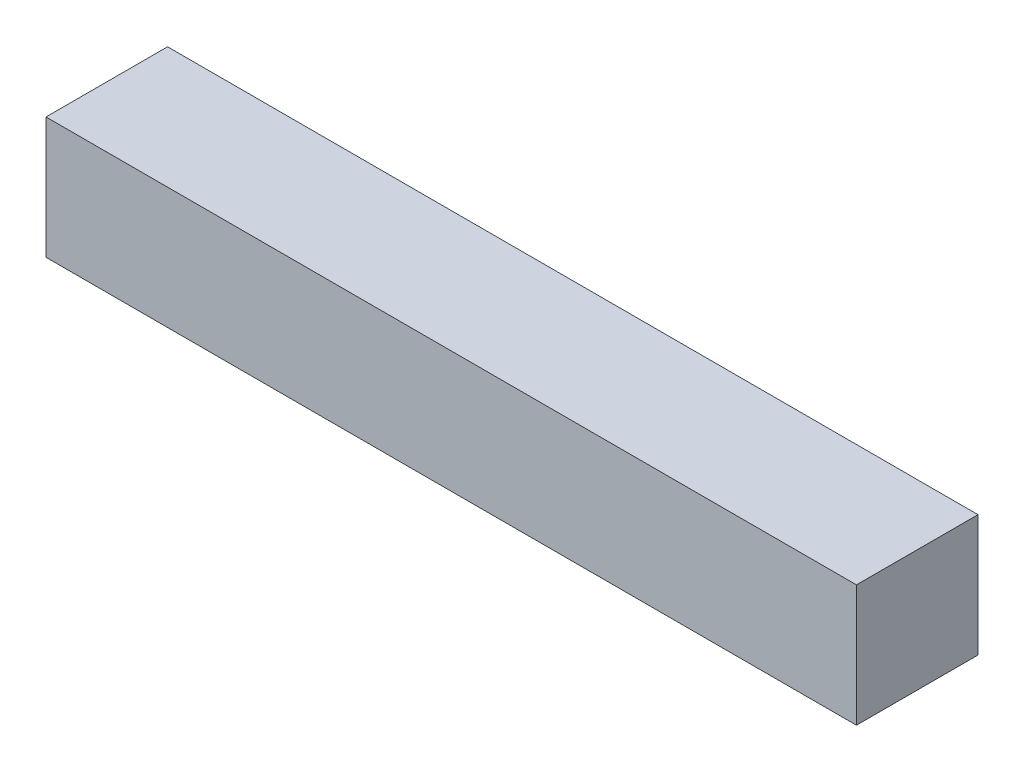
from build123d import *

# Parameters (mm, degrees)
SKETCH_1_W      = 1000
SKETCH_1_H      = 150
EXTRUDE_1_DEPTH = 150


with BuildPart() as part:
    # Sketch 1 → Extrude 1 (new body)
    with BuildSketch(Plane(origin=(0, 0, 0), x_dir=(1, 0, 0), z_dir=(0, 1, 0))):
        with Locations((280.333323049, -1420.771797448)):
            Rectangle(SKETCH_1_W, SKETCH_1_H)
    extrude(amount=EXTRUDE_1_DEPTH)


solid = part.part
